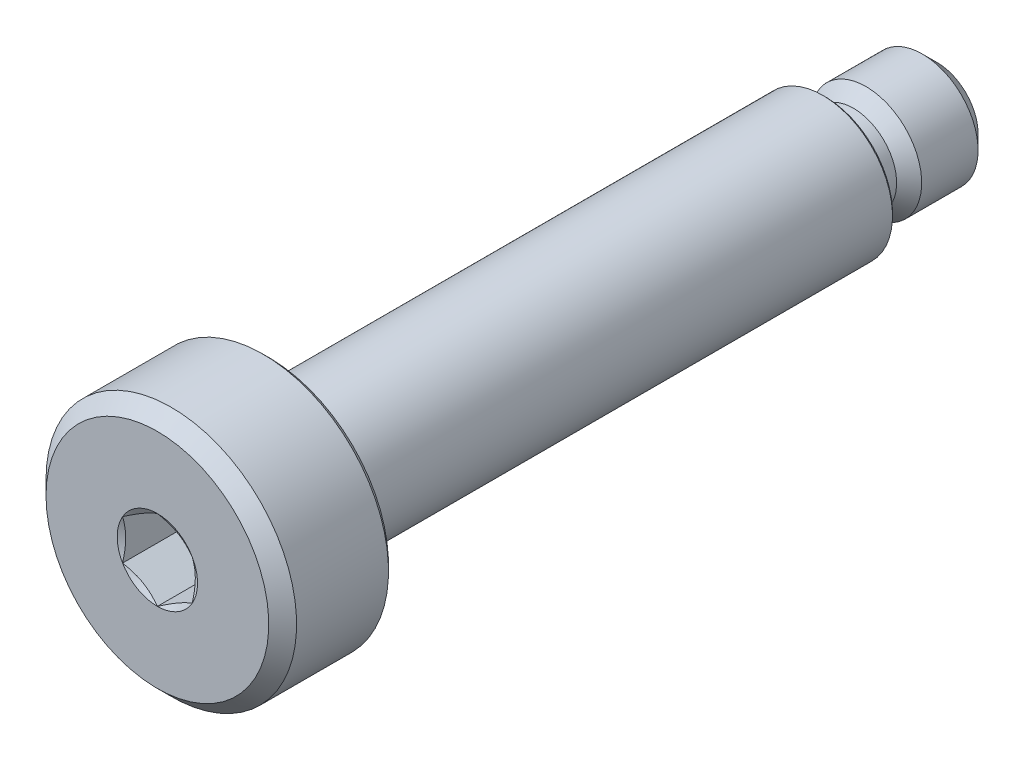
from build123d import *

# Parameters (mm, degrees)
CUT_EXTRUDE1_DEPTH = 2


with BuildPart() as part:
    # Sketch6 → Revolve1 (revolve)
    with BuildSketch(Plane(origin=(0, 0, 0), x_dir=(0, 0, -1), z_dir=(1, 0, 0)), mode=Mode.PRIVATE) as revolve1_sk:
        Polygon((-14, 0), (-14, 4), (-13.5, 4.5), (-10.2, 4.5), (-10, 4.3), (-10, 2.4), (-9.26, 2.4), (-9.16, 2.5), (9.9, 2.5), (10, 2.4), (10, 1.55), (11, 1.55), (11.45, 2), (13.475, 2), (14, 1.475), (14, 0), align=None)
    revolve(revolve1_sk.sketch.rotate(Axis((0, 0, -14), (0, 0, 1)), 90), axis=Axis((0, 0, -14), (0, 0, 1)))

    # Sketch7 → Cut-Extrude1 (cut)
    with BuildSketch(Plane.XY.offset(14)):
        Polygon((0, -1.443375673), (1.25, -0.721687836), (1.25, 0.721687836), (0, 1.443375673), (-1.25, 0.721687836), (-1.25, -0.721687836), align=None)
    extrude(amount=-CUT_EXTRUDE1_DEPTH, mode=Mode.SUBTRACT)

    # Cut-Extrude2 cone 1 section (on through the dimple's axis) → Cut-Extrude2 (revolve, cut)
    with BuildSketch(Plane(origin=(0, 0, 14), x_dir=(0, -1, 0), z_dir=(1, 0, 0))):
        Polygon((0, 0), (1.443375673, 0), (0, 0.833333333), align=None)
    revolve(axis=Axis((0, 0, 14), (0, 0, -1)), mode=Mode.SUBTRACT)


solid = part.part
